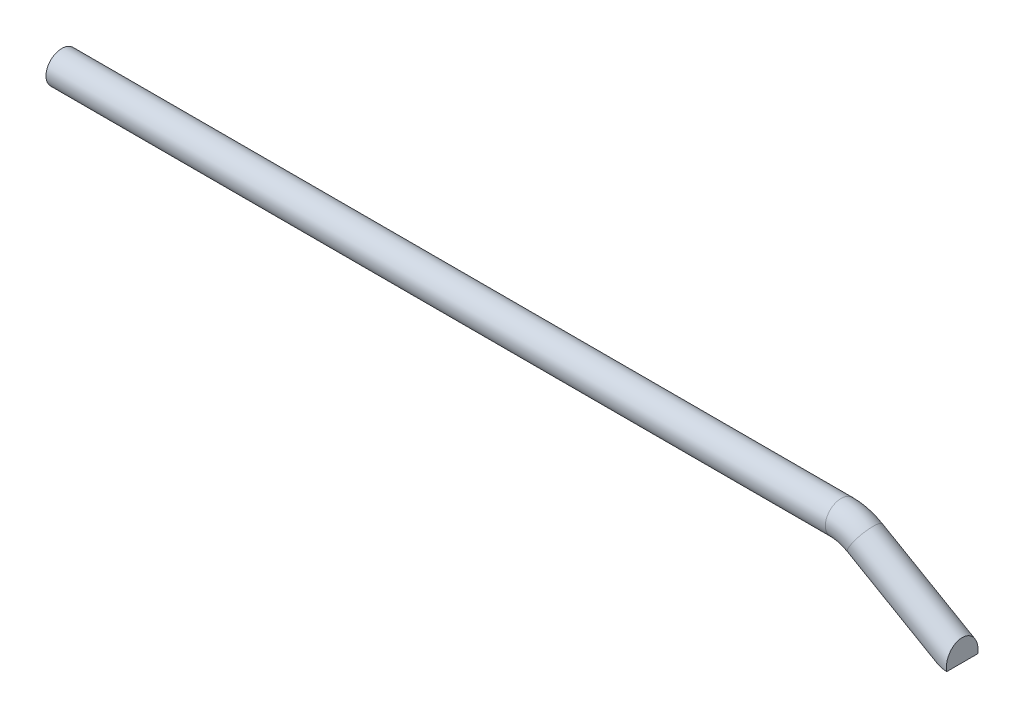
from build123d import *

# Parameters (mm, degrees)
ESQUISSE2_R             = 6
ENL_V_MAT_EXTRU_1_DEPTH = 10


with BuildPart() as part:
    # Balayage1: sweep along a path in Esquisse1
    with BuildLine(Plane.XY) as balayage1_path:
        Line((0, 0), (295.176914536, 0))
        ThreePointArc((295.176914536, 0), (299.835657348, -0.613335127), (304.176914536, -2.411542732))
        Line((304.176914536, -2.411542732), (350, -28.867513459))
    # Esquisse2 → Balayage1 (sweep)
    with BuildSketch(Plane(origin=(0, 0, 0), x_dir=(0, 0, -1), z_dir=(1, 0, 0))):
        Circle(ESQUISSE2_R)
    sweep(path=balayage1_path.line)

    # Esquisse3 → Enl_v. mat.-Extru.1 (cut, symmetric)
    with BuildSketch(Plane.XY):
        Polygon((341, -25), (341, -16.743157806), (353, -23.671361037), (347, -34.063665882), (331.301270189, -25), align=None)
    extrude(amount=ENL_V_MAT_EXTRU_1_DEPTH, both=True, mode=Mode.SUBTRACT)


solid = part.part
